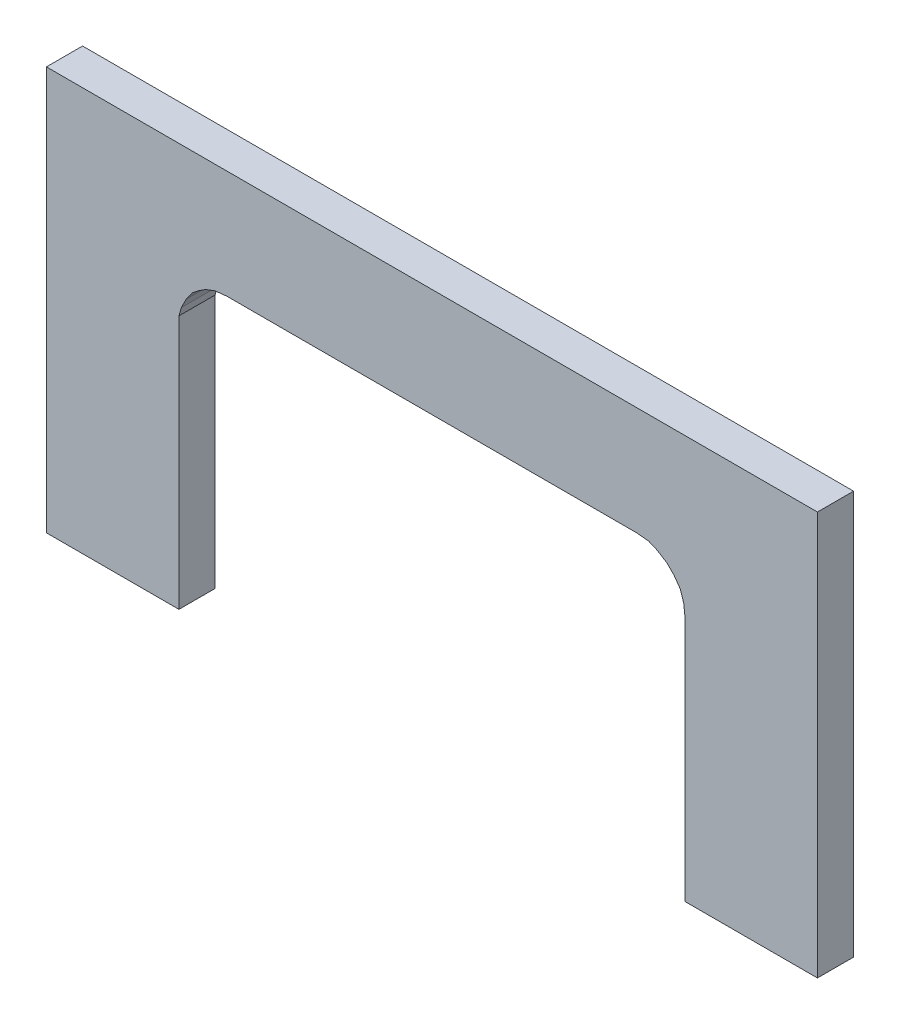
ISO-10303-21;
HEADER;
FILE_DESCRIPTION(('STEP AP214'),'2;1');
FILE_NAME('part.step','',(''),(''),'','','');
FILE_SCHEMA(('AUTOMOTIVE_DESIGN { 1 0 10303 214 1 1 1 1 }'));
ENDSEC;
DATA;
#1=APPLICATION_CONTEXT('core data for automotive mechanical design processes');
#2=APPLICATION_PROTOCOL_DEFINITION('international standard','automotive_design',2000,#1);
#3=PRODUCT_CONTEXT('',#1,'mechanical');
#4=PRODUCT('Part','Part','',(#3));
#5=PRODUCT_RELATED_PRODUCT_CATEGORY('part','',(#4));
#6=PRODUCT_DEFINITION_FORMATION('','',#4);
#7=PRODUCT_DEFINITION_CONTEXT('part definition',#1,'design');
#8=PRODUCT_DEFINITION('design','',#6,#7);
#9=PRODUCT_DEFINITION_SHAPE('','',#8);
#10=(LENGTH_UNIT() NAMED_UNIT(*) SI_UNIT(.MILLI.,.METRE.));
#11=(NAMED_UNIT(*) PLANE_ANGLE_UNIT() SI_UNIT($,.RADIAN.));
#12=(NAMED_UNIT(*) SI_UNIT($,.STERADIAN.) SOLID_ANGLE_UNIT());
#13=UNCERTAINTY_MEASURE_WITH_UNIT(LENGTH_MEASURE(1.E-05),#10,'distance_accuracy_value','');
#14=(GEOMETRIC_REPRESENTATION_CONTEXT(3) GLOBAL_UNCERTAINTY_ASSIGNED_CONTEXT((#13)) GLOBAL_UNIT_ASSIGNED_CONTEXT((#10,
#11,#12)) REPRESENTATION_CONTEXT('',''));
#15=CARTESIAN_POINT('',(0.,0.,0.));
#16=DIRECTION('',(0.,0.,1.));
#17=DIRECTION('',(1.,0.,0.));
#18=AXIS2_PLACEMENT_3D('',#15,#16,#17);
#19=CARTESIAN_POINT('',(-3.19999868,-1.67500046,0.2999994));
#20=DIRECTION('',(0.,0.,1.));
#21=DIRECTION('',(1.,0.,0.));
#22=AXIS2_PLACEMENT_3D('',#19,#20,#21);
#23=PLANE('',#22);
#24=DIRECTION('',(1.,0.,0.));
#25=VECTOR('',#24,1.);
#26=CARTESIAN_POINT('',(-3.19999868,1.67500046,0.2999994));
#27=LINE('',#26,#25);
#28=CARTESIAN_POINT('',(-3.19999868,1.67500046,0.2999994));
#29=VERTEX_POINT('',#28);
#30=CARTESIAN_POINT('',(3.19999868,1.67500046,0.2999994));
#31=VERTEX_POINT('',#30);
#32=EDGE_CURVE('E257',#29,#31,#27,.T.);
#33=ORIENTED_EDGE('',*,*,#32,.F.);
#34=DIRECTION('',(0.,1.,0.));
#35=VECTOR('',#34,1.);
#36=CARTESIAN_POINT('',(-3.19999868,-1.67500046,0.2999994));
#37=LINE('',#36,#35);
#38=CARTESIAN_POINT('',(-3.19999868,-1.67500046,0.2999994));
#39=VERTEX_POINT('',#38);
#40=EDGE_CURVE('E178',#39,#29,#37,.T.);
#41=ORIENTED_EDGE('',*,*,#40,.F.);
#42=DIRECTION('',(1.,0.,0.));
#43=VECTOR('',#42,1.);
#44=CARTESIAN_POINT('',(-2.10000088,-1.67500046,0.2999994));
#45=LINE('',#44,#43);
#46=CARTESIAN_POINT('',(-2.10000088,-1.67500046,0.2999994));
#47=VERTEX_POINT('',#46);
#48=EDGE_CURVE('E20',#47,#39,#45,.F.);
#49=ORIENTED_EDGE('',*,*,#48,.F.);
#50=DIRECTION('',(0.,1.,0.));
#51=VECTOR('',#50,1.);
#52=CARTESIAN_POINT('',(-2.10000088,0.4350004,0.2999994));
#53=LINE('',#52,#51);
#54=CARTESIAN_POINT('',(-2.10000087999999,0.435000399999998,0.2999994));
#55=VERTEX_POINT('',#54);
#56=EDGE_CURVE('E167',#55,#47,#53,.F.);
#57=ORIENTED_EDGE('',*,*,#56,.F.);
#58=DIRECTION('',(0.274721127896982,0.961523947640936,0.));
#59=VECTOR('',#58,1.);
#60=CARTESIAN_POINT('',(-2.08000092,0.50500026,0.2999994));
#61=LINE('',#60,#59);
#62=CARTESIAN_POINT('',(-2.08000092,0.50500026,0.2999994));
#63=VERTEX_POINT('',#62);
#64=EDGE_CURVE('E162',#63,#55,#61,.F.);
#65=ORIENTED_EDGE('',*,*,#64,.F.);
#66=DIRECTION('',(0.447213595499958,0.894427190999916,0.));
#67=VECTOR('',#66,1.);
#68=CARTESIAN_POINT('',(-2.040001,0.5850001,0.2999994));
#69=LINE('',#68,#67);
#70=CARTESIAN_POINT('',(-2.040001,0.585000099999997,0.2999994));
#71=VERTEX_POINT('',#70);
#72=EDGE_CURVE('E189',#71,#63,#69,.F.);
#73=ORIENTED_EDGE('',*,*,#72,.F.);
#74=DIRECTION('',(0.581238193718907,0.81373347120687,0.));
#75=VECTOR('',#74,1.);
#76=CARTESIAN_POINT('',(-1.9900011,0.65499996,0.2999994));
#77=LINE('',#76,#75);
#78=CARTESIAN_POINT('',(-1.9900011,0.654999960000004,0.2999994));
#79=VERTEX_POINT('',#78);
#80=EDGE_CURVE('E193',#79,#71,#77,.F.);
#81=ORIENTED_EDGE('',*,*,#80,.F.);
#82=DIRECTION('',(0.780868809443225,0.62469504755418,0.));
#83=VECTOR('',#82,1.);
#84=CARTESIAN_POINT('',(-1.9400012,0.69499988,0.2999994));
#85=LINE('',#84,#83);
#86=CARTESIAN_POINT('',(-1.9400012,0.694999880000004,0.2999994));
#87=VERTEX_POINT('',#86);
#88=EDGE_CURVE('E197',#87,#79,#85,.F.);
#89=ORIENTED_EDGE('',*,*,#88,.F.);
#90=DIRECTION('',(0.832050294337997,0.554700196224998,0.));
#91=VECTOR('',#90,1.);
#92=CARTESIAN_POINT('',(-1.88000132,0.7349998,0.2999994));
#93=LINE('',#92,#91);
#94=CARTESIAN_POINT('',(-1.88000132,0.734999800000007,0.2999994));
#95=VERTEX_POINT('',#94);
#96=EDGE_CURVE('E201',#95,#87,#93,.F.);
#97=ORIENTED_EDGE('',*,*,#96,.F.);
#98=DIRECTION('',(0.936329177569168,0.351123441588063,0.));
#99=VECTOR('',#98,1.);
#100=CARTESIAN_POINT('',(-1.80000148,0.76499974,0.2999994));
#101=LINE('',#100,#99);
#102=CARTESIAN_POINT('',(-1.80000148,0.764999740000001,0.2999994));
#103=VERTEX_POINT('',#102);
#104=EDGE_CURVE('E205',#103,#95,#101,.F.);
#105=ORIENTED_EDGE('',*,*,#104,.F.);
#106=DIRECTION('',(0.995037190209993,0.0995037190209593,0.));
#107=VECTOR('',#106,1.);
#108=CARTESIAN_POINT('',(-1.70000168,0.77499972,0.2999994));
#109=LINE('',#108,#107);
#110=CARTESIAN_POINT('',(-1.70000168,0.77499972,0.2999994));
#111=VERTEX_POINT('',#110);
#112=EDGE_CURVE('E209',#111,#103,#109,.F.);
#113=ORIENTED_EDGE('',*,*,#112,.F.);
#114=DIRECTION('',(1.,0.,0.));
#115=VECTOR('',#114,1.);
#116=CARTESIAN_POINT('',(1.70000168,0.77499972,0.2999994));
#117=LINE('',#116,#115);
#118=CARTESIAN_POINT('',(1.70000168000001,0.774999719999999,0.2999994));
#119=VERTEX_POINT('',#118);
#120=EDGE_CURVE('E213',#119,#111,#117,.F.);
#121=ORIENTED_EDGE('',*,*,#120,.F.);
#122=DIRECTION('',(0.995036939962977,-0.0995062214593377,0.));
#123=VECTOR('',#122,1.);
#124=CARTESIAN_POINT('',(1.79999894,0.76499974,0.2999994));
#125=LINE('',#124,#123);
#126=CARTESIAN_POINT('',(1.79999894,0.764999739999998,0.2999994));
#127=VERTEX_POINT('',#126);
#128=EDGE_CURVE('E217',#127,#119,#125,.F.);
#129=ORIENTED_EDGE('',*,*,#128,.F.);
#130=DIRECTION('',(0.91914503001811,-0.393919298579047,0.));
#131=VECTOR('',#130,1.);
#132=CARTESIAN_POINT('',(1.8699988,0.7349998,0.2999994));
#133=LINE('',#132,#131);
#134=CARTESIAN_POINT('',(1.8699988,0.734999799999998,0.2999994));
#135=VERTEX_POINT('',#134);
#136=EDGE_CURVE('E221',#135,#127,#133,.F.);
#137=ORIENTED_EDGE('',*,*,#136,.F.);
#138=DIRECTION('',(0.847998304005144,-0.52999894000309,0.));
#139=VECTOR('',#138,1.);
#140=CARTESIAN_POINT('',(1.94999864,0.6849999,0.2999994));
#141=LINE('',#140,#139);
#142=CARTESIAN_POINT('',(1.94999864,0.6849999,0.2999994));
#143=VERTEX_POINT('',#142);
#144=EDGE_CURVE('E225',#143,#135,#141,.F.);
#145=ORIENTED_EDGE('',*,*,#144,.F.);
#146=DIRECTION('',(0.707106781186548,-0.707106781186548,0.));
#147=VECTOR('',#146,1.);
#148=CARTESIAN_POINT('',(2.00999852,0.62500002,0.2999994));
#149=LINE('',#148,#147);
#150=CARTESIAN_POINT('',(2.00999852,0.625000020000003,0.2999994));
#151=VERTEX_POINT('',#150);
#152=EDGE_CURVE('E229',#151,#143,#149,.F.);
#153=ORIENTED_EDGE('',*,*,#152,.F.);
#154=DIRECTION('',(0.581238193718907,-0.81373347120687,0.));
#155=VECTOR('',#154,1.);
#156=CARTESIAN_POINT('',(2.05999842,0.55500016,0.2999994));
#157=LINE('',#156,#155);
#158=CARTESIAN_POINT('',(2.05999842,0.55500016,0.2999994));
#159=VERTEX_POINT('',#158);
#160=EDGE_CURVE('E233',#159,#151,#157,.F.);
#161=ORIENTED_EDGE('',*,*,#160,.F.);
#162=DIRECTION('',(0.316227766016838,-0.948683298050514,0.));
#163=VECTOR('',#162,1.);
#164=CARTESIAN_POINT('',(2.08999836,0.46500034,0.2999994));
#165=LINE('',#164,#163);
#166=CARTESIAN_POINT('',(2.08999835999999,0.465000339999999,0.2999994));
#167=VERTEX_POINT('',#166);
#168=EDGE_CURVE('E237',#167,#159,#165,.F.);
#169=ORIENTED_EDGE('',*,*,#168,.F.);
#170=DIRECTION('',(0.110459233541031,-0.993880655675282,0.));
#171=VECTOR('',#170,1.);
#172=CARTESIAN_POINT('',(2.10000088,0.37500052,0.2999994));
#173=LINE('',#172,#171);
#174=CARTESIAN_POINT('',(2.10000088,0.375000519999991,0.2999994));
#175=VERTEX_POINT('',#174);
#176=EDGE_CURVE('E241',#175,#167,#173,.F.);
#177=ORIENTED_EDGE('',*,*,#176,.F.);
#178=DIRECTION('',(0.,1.,0.));
#179=VECTOR('',#178,1.);
#180=CARTESIAN_POINT('',(2.10000088,-1.67500046,0.2999994));
#181=LINE('',#180,#179);
#182=CARTESIAN_POINT('',(2.10000088,-1.67500046,0.2999994));
#183=VERTEX_POINT('',#182);
#184=EDGE_CURVE('E245',#183,#175,#181,.T.);
#185=ORIENTED_EDGE('',*,*,#184,.F.);
#186=DIRECTION('',(1.,0.,0.));
#187=VECTOR('',#186,1.);
#188=CARTESIAN_POINT('',(3.19999868,-1.67500046,0.2999994));
#189=LINE('',#188,#187);
#190=CARTESIAN_POINT('',(3.19999868,-1.67500046,0.2999994));
#191=VERTEX_POINT('',#190);
#192=EDGE_CURVE('E249',#191,#183,#189,.F.);
#193=ORIENTED_EDGE('',*,*,#192,.F.);
#194=DIRECTION('',(0.,1.,0.));
#195=VECTOR('',#194,1.);
#196=CARTESIAN_POINT('',(3.19999868,1.67500046,0.2999994));
#197=LINE('',#196,#195);
#198=EDGE_CURVE('E253',#31,#191,#197,.F.);
#199=ORIENTED_EDGE('',*,*,#198,.F.);
#200=EDGE_LOOP('',(#33,#41,#49,#57,#65,#73,#81,#89,#97,#105,#113,#121,#129,#137,#145,#153,#161,
#169,#177,#185,#193,#199));
#201=FACE_BOUND('',#200,.T.);
#202=ADVANCED_FACE('F17',(#201),#23,.T.);
#203=CARTESIAN_POINT('',(-2.10000088,-1.67500046,0.));
#204=DIRECTION('',(0.,-1.,0.));
#205=DIRECTION('',(0.,0.,-1.));
#206=AXIS2_PLACEMENT_3D('',#203,#204,#205);
#207=PLANE('',#206);
#208=DIRECTION('',(0.,0.,1.));
#209=VECTOR('',#208,1.);
#210=CARTESIAN_POINT('',(-3.19999868,-1.67500046,0.));
#211=LINE('',#210,#209);
#212=CARTESIAN_POINT('',(-3.19999868,-1.67500046,0.));
#213=VERTEX_POINT('',#212);
#214=EDGE_CURVE('E261',#213,#39,#211,.T.);
#215=ORIENTED_EDGE('',*,*,#214,.F.);
#216=DIRECTION('',(1.,0.,0.));
#217=VECTOR('',#216,1.);
#218=CARTESIAN_POINT('',(-3.19999868,-1.67500046,0.));
#219=LINE('',#218,#217);
#220=CARTESIAN_POINT('',(-2.10000088,-1.67500046,0.));
#221=VERTEX_POINT('',#220);
#222=EDGE_CURVE('E184',#213,#221,#219,.T.);
#223=ORIENTED_EDGE('',*,*,#222,.T.);
#224=DIRECTION('',(0.,0.,-1.));
#225=VECTOR('',#224,1.);
#226=CARTESIAN_POINT('',(-2.10000088,-1.67500046,0.));
#227=LINE('',#226,#225);
#228=EDGE_CURVE('E172',#47,#221,#227,.T.);
#229=ORIENTED_EDGE('',*,*,#228,.F.);
#230=ORIENTED_EDGE('',*,*,#48,.T.);
#231=EDGE_LOOP('',(#215,#223,#229,#230));
#232=FACE_BOUND('',#231,.T.);
#233=ADVANCED_FACE('F183',(#232),#207,.T.);
#234=CARTESIAN_POINT('',(-2.10000088,0.4350004,0.));
#235=DIRECTION('',(1.,0.,0.));
#236=DIRECTION('',(0.,0.,-1.));
#237=AXIS2_PLACEMENT_3D('',#234,#235,#236);
#238=PLANE('',#237);
#239=ORIENTED_EDGE('',*,*,#228,.T.);
#240=DIRECTION('',(0.,1.,0.));
#241=VECTOR('',#240,1.);
#242=CARTESIAN_POINT('',(-2.10000088,-1.67500046,0.));
#243=LINE('',#242,#241);
#244=CARTESIAN_POINT('',(-2.10000087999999,0.435000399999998,0.));
#245=VERTEX_POINT('',#244);
#246=EDGE_CURVE('E266',#221,#245,#243,.T.);
#247=ORIENTED_EDGE('',*,*,#246,.T.);
#248=DIRECTION('',(0.,0.,1.));
#249=VECTOR('',#248,1.);
#250=CARTESIAN_POINT('',(-2.10000087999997,0.435000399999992,0.));
#251=LINE('',#250,#249);
#252=EDGE_CURVE('E174',#55,#245,#251,.F.);
#253=ORIENTED_EDGE('',*,*,#252,.F.);
#254=ORIENTED_EDGE('',*,*,#56,.T.);
#255=EDGE_LOOP('',(#239,#247,#253,#254));
#256=FACE_BOUND('',#255,.T.);
#257=ADVANCED_FACE('F169',(#256),#238,.T.);
#258=CARTESIAN_POINT('',(-2.08000092,0.50500026,0.));
#259=DIRECTION('',(0.961523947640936,-0.274721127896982,0.));
#260=DIRECTION('',(0.274721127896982,0.961523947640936,0.));
#261=AXIS2_PLACEMENT_3D('',#258,#259,#260);
#262=PLANE('',#261);
#263=ORIENTED_EDGE('',*,*,#252,.T.);
#264=DIRECTION('',(0.274721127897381,0.961523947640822,0.));
#265=VECTOR('',#264,1.);
#266=CARTESIAN_POINT('',(-2.10000088,0.4350004,0.));
#267=LINE('',#266,#265);
#268=CARTESIAN_POINT('',(-2.08000092,0.50500026,0.));
#269=VERTEX_POINT('',#268);
#270=EDGE_CURVE('E268',#245,#269,#267,.T.);
#271=ORIENTED_EDGE('',*,*,#270,.T.);
#272=DIRECTION('',(0.,0.,1.));
#273=VECTOR('',#272,1.);
#274=CARTESIAN_POINT('',(-2.08000092,0.50500026,0.));
#275=LINE('',#274,#273);
#276=EDGE_CURVE('E191',#63,#269,#275,.F.);
#277=ORIENTED_EDGE('',*,*,#276,.F.);
#278=ORIENTED_EDGE('',*,*,#64,.T.);
#279=EDGE_LOOP('',(#263,#271,#277,#278));
#280=FACE_BOUND('',#279,.T.);
#281=ADVANCED_FACE('F414',(#280),#262,.T.);
#282=CARTESIAN_POINT('',(-2.040001,0.5850001,0.));
#283=DIRECTION('',(0.894427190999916,-0.447213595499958,0.));
#284=DIRECTION('',(0.447213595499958,0.894427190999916,0.));
#285=AXIS2_PLACEMENT_3D('',#282,#283,#284);
#286=PLANE('',#285);
#287=ORIENTED_EDGE('',*,*,#276,.T.);
#288=DIRECTION('',(0.447213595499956,0.894427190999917,0.));
#289=VECTOR('',#288,1.);
#290=CARTESIAN_POINT('',(-2.08000092,0.50500026,0.));
#291=LINE('',#290,#289);
#292=CARTESIAN_POINT('',(-2.040001,0.585000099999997,0.));
#293=VERTEX_POINT('',#292);
#294=EDGE_CURVE('E271',#269,#293,#291,.T.);
#295=ORIENTED_EDGE('',*,*,#294,.T.);
#296=DIRECTION('',(0.,0.,1.));
#297=VECTOR('',#296,1.);
#298=CARTESIAN_POINT('',(-2.04000099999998,0.585000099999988,0.));
#299=LINE('',#298,#297);
#300=EDGE_CURVE('E195',#71,#293,#299,.F.);
#301=ORIENTED_EDGE('',*,*,#300,.F.);
#302=ORIENTED_EDGE('',*,*,#72,.T.);
#303=EDGE_LOOP('',(#287,#295,#301,#302));
#304=FACE_BOUND('',#303,.T.);
#305=ADVANCED_FACE('F413',(#304),#286,.T.);
#306=CARTESIAN_POINT('',(-1.9900011,0.65499996,0.));
#307=DIRECTION('',(0.81373347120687,-0.581238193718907,0.));
#308=DIRECTION('',(0.581238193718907,0.81373347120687,0.));
#309=AXIS2_PLACEMENT_3D('',#306,#307,#308);
#310=PLANE('',#309);
#311=ORIENTED_EDGE('',*,*,#300,.T.);
#312=DIRECTION('',(0.581238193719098,0.813733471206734,0.));
#313=VECTOR('',#312,1.);
#314=CARTESIAN_POINT('',(-2.040001,0.5850001,0.));
#315=LINE('',#314,#313);
#316=CARTESIAN_POINT('',(-1.9900011,0.654999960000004,0.));
#317=VERTEX_POINT('',#316);
#318=EDGE_CURVE('E274',#293,#317,#315,.T.);
#319=ORIENTED_EDGE('',*,*,#318,.T.);
#320=DIRECTION('',(0.,0.,1.));
#321=VECTOR('',#320,1.);
#322=CARTESIAN_POINT('',(-1.99000110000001,0.654999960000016,0.));
#323=LINE('',#322,#321);
#324=EDGE_CURVE('E199',#79,#317,#323,.F.);
#325=ORIENTED_EDGE('',*,*,#324,.F.);
#326=ORIENTED_EDGE('',*,*,#80,.T.);
#327=EDGE_LOOP('',(#311,#319,#325,#326));
#328=FACE_BOUND('',#327,.T.);
#329=ADVANCED_FACE('F407',(#328),#310,.T.);
#330=CARTESIAN_POINT('',(-1.9400012,0.69499988,0.));
#331=DIRECTION('',(0.62469504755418,-0.780868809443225,0.));
#332=DIRECTION('',(0.780868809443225,0.62469504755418,0.));
#333=AXIS2_PLACEMENT_3D('',#330,#331,#332);
#334=PLANE('',#333);
#335=ORIENTED_EDGE('',*,*,#324,.T.);
#336=DIRECTION('',(0.78086880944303,0.624695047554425,0.));
#337=VECTOR('',#336,1.);
#338=CARTESIAN_POINT('',(-1.9900011,0.65499996,0.));
#339=LINE('',#338,#337);
#340=CARTESIAN_POINT('',(-1.9400012,0.694999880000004,0.));
#341=VERTEX_POINT('',#340);
#342=EDGE_CURVE('E277',#317,#341,#339,.T.);
#343=ORIENTED_EDGE('',*,*,#342,.T.);
#344=DIRECTION('',(0.,0.,1.));
#345=VECTOR('',#344,1.);
#346=CARTESIAN_POINT('',(-1.94000120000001,0.694999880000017,0.));
#347=LINE('',#346,#345);
#348=EDGE_CURVE('E203',#87,#341,#347,.F.);
#349=ORIENTED_EDGE('',*,*,#348,.F.);
#350=ORIENTED_EDGE('',*,*,#88,.T.);
#351=EDGE_LOOP('',(#335,#343,#349,#350));
#352=FACE_BOUND('',#351,.T.);
#353=ADVANCED_FACE('F403',(#352),#334,.T.);
#354=CARTESIAN_POINT('',(-1.88000132,0.7349998,0.));
#355=DIRECTION('',(0.554700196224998,-0.832050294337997,0.));
#356=DIRECTION('',(0.832050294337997,0.554700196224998,0.));
#357=AXIS2_PLACEMENT_3D('',#354,#355,#356);
#358=PLANE('',#357);
#359=ORIENTED_EDGE('',*,*,#348,.T.);
#360=DIRECTION('',(0.832050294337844,0.554700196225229,0.));
#361=VECTOR('',#360,1.);
#362=CARTESIAN_POINT('',(-1.9400012,0.69499988,0.));
#363=LINE('',#362,#361);
#364=CARTESIAN_POINT('',(-1.88000132,0.734999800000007,0.));
#365=VERTEX_POINT('',#364);
#366=EDGE_CURVE('E280',#341,#365,#363,.T.);
#367=ORIENTED_EDGE('',*,*,#366,.T.);
#368=DIRECTION('',(0.,0.,1.));
#369=VECTOR('',#368,1.);
#370=CARTESIAN_POINT('',(-1.88000132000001,0.734999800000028,0.));
#371=LINE('',#370,#369);
#372=EDGE_CURVE('E207',#95,#365,#371,.F.);
#373=ORIENTED_EDGE('',*,*,#372,.F.);
#374=ORIENTED_EDGE('',*,*,#96,.T.);
#375=EDGE_LOOP('',(#359,#367,#373,#374));
#376=FACE_BOUND('',#375,.T.);
#377=ADVANCED_FACE('F397',(#376),#358,.T.);
#378=CARTESIAN_POINT('',(-1.80000148,0.76499974,0.));
#379=DIRECTION('',(0.351123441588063,-0.936329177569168,0.));
#380=DIRECTION('',(0.936329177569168,0.351123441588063,0.));
#381=AXIS2_PLACEMENT_3D('',#378,#379,#380);
#382=PLANE('',#381);
#383=ORIENTED_EDGE('',*,*,#372,.T.);
#384=DIRECTION('',(0.936329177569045,0.35112344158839,0.));
#385=VECTOR('',#384,1.);
#386=CARTESIAN_POINT('',(-1.88000132,0.7349998,0.));
#387=LINE('',#386,#385);
#388=CARTESIAN_POINT('',(-1.80000148,0.764999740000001,0.));
#389=VERTEX_POINT('',#388);
#390=EDGE_CURVE('E283',#365,#389,#387,.T.);
#391=ORIENTED_EDGE('',*,*,#390,.T.);
#392=DIRECTION('',(0.,0.,1.));
#393=VECTOR('',#392,1.);
#394=CARTESIAN_POINT('',(-1.80000148,0.764999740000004,0.));
#395=LINE('',#394,#393);
#396=EDGE_CURVE('E211',#103,#389,#395,.F.);
#397=ORIENTED_EDGE('',*,*,#396,.F.);
#398=ORIENTED_EDGE('',*,*,#104,.T.);
#399=EDGE_LOOP('',(#383,#391,#397,#398));
#400=FACE_BOUND('',#399,.T.);
#401=ADVANCED_FACE('F393',(#400),#382,.T.);
#402=CARTESIAN_POINT('',(-1.70000168,0.77499972,0.));
#403=DIRECTION('',(0.0995037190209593,-0.995037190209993,0.));
#404=DIRECTION('',(0.995037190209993,0.0995037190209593,0.));
#405=AXIS2_PLACEMENT_3D('',#402,#403,#404);
#406=PLANE('',#405);
#407=ORIENTED_EDGE('',*,*,#396,.T.);
#408=DIRECTION('',(0.995037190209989,0.099503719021,0.));
#409=VECTOR('',#408,1.);
#410=CARTESIAN_POINT('',(-1.80000148,0.76499974,0.));
#411=LINE('',#410,#409);
#412=CARTESIAN_POINT('',(-1.70000168,0.77499972,0.));
#413=VERTEX_POINT('',#412);
#414=EDGE_CURVE('E286',#389,#413,#411,.T.);
#415=ORIENTED_EDGE('',*,*,#414,.T.);
#416=DIRECTION('',(0.,0.,-1.));
#417=VECTOR('',#416,1.);
#418=CARTESIAN_POINT('',(-1.70000168,0.77499972,0.));
#419=LINE('',#418,#417);
#420=EDGE_CURVE('E215',#111,#413,#419,.T.);
#421=ORIENTED_EDGE('',*,*,#420,.F.);
#422=ORIENTED_EDGE('',*,*,#112,.T.);
#423=EDGE_LOOP('',(#407,#415,#421,#422));
#424=FACE_BOUND('',#423,.T.);
#425=ADVANCED_FACE('F387',(#424),#406,.T.);
#426=CARTESIAN_POINT('',(1.70000168,0.77499972,0.));
#427=DIRECTION('',(0.,-1.,0.));
#428=DIRECTION('',(0.,0.,-1.));
#429=AXIS2_PLACEMENT_3D('',#426,#427,#428);
#430=PLANE('',#429);
#431=ORIENTED_EDGE('',*,*,#420,.T.);
#432=DIRECTION('',(1.,0.,0.));
#433=VECTOR('',#432,1.);
#434=CARTESIAN_POINT('',(-3.19999868,0.77499972,0.));
#435=LINE('',#434,#433);
#436=CARTESIAN_POINT('',(1.70000168,0.774999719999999,0.));
#437=VERTEX_POINT('',#436);
#438=EDGE_CURVE('E289',#413,#437,#435,.T.);
#439=ORIENTED_EDGE('',*,*,#438,.T.);
#440=DIRECTION('',(0.,0.,1.));
#441=VECTOR('',#440,1.);
#442=CARTESIAN_POINT('',(1.70000168,0.774999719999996,0.));
#443=LINE('',#442,#441);
#444=EDGE_CURVE('E219',#119,#437,#443,.F.);
#445=ORIENTED_EDGE('',*,*,#444,.F.);
#446=ORIENTED_EDGE('',*,*,#120,.T.);
#447=EDGE_LOOP('',(#431,#439,#445,#446));
#448=FACE_BOUND('',#447,.T.);
#449=ADVANCED_FACE('F383',(#448),#430,.T.);
#450=CARTESIAN_POINT('',(1.79999894,0.76499974,0.));
#451=DIRECTION('',(-0.0995062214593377,-0.995036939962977,0.));
#452=DIRECTION('',(0.995036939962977,-0.0995062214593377,0.));
#453=AXIS2_PLACEMENT_3D('',#450,#451,#452);
#454=PLANE('',#453);
#455=ORIENTED_EDGE('',*,*,#444,.T.);
#456=DIRECTION('',(0.995036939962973,-0.0995062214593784,0.));
#457=VECTOR('',#456,1.);
#458=CARTESIAN_POINT('',(1.70000168,0.77499972,0.));
#459=LINE('',#458,#457);
#460=CARTESIAN_POINT('',(1.79999894,0.764999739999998,0.));
#461=VERTEX_POINT('',#460);
#462=EDGE_CURVE('E292',#437,#461,#459,.T.);
#463=ORIENTED_EDGE('',*,*,#462,.T.);
#464=DIRECTION('',(0.,0.,1.));
#465=VECTOR('',#464,1.);
#466=CARTESIAN_POINT('',(1.79999894,0.764999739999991,0.));
#467=LINE('',#466,#465);
#468=EDGE_CURVE('E223',#127,#461,#467,.F.);
#469=ORIENTED_EDGE('',*,*,#468,.F.);
#470=ORIENTED_EDGE('',*,*,#128,.T.);
#471=EDGE_LOOP('',(#455,#463,#469,#470));
#472=FACE_BOUND('',#471,.T.);
#473=ADVANCED_FACE('F377',(#472),#454,.T.);
#474=CARTESIAN_POINT('',(1.8699988,0.7349998,0.));
#475=DIRECTION('',(-0.393919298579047,-0.91914503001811,0.));
#476=DIRECTION('',(0.91914503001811,-0.393919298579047,0.));
#477=AXIS2_PLACEMENT_3D('',#474,#475,#476);
#478=PLANE('',#477);
#479=ORIENTED_EDGE('',*,*,#468,.T.);
#480=DIRECTION('',(0.919145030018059,-0.393919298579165,0.));
#481=VECTOR('',#480,1.);
#482=CARTESIAN_POINT('',(1.79999894,0.76499974,0.));
#483=LINE('',#482,#481);
#484=CARTESIAN_POINT('',(1.8699988,0.734999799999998,0.));
#485=VERTEX_POINT('',#484);
#486=EDGE_CURVE('E295',#461,#485,#483,.T.);
#487=ORIENTED_EDGE('',*,*,#486,.T.);
#488=DIRECTION('',(0.,0.,1.));
#489=VECTOR('',#488,1.);
#490=CARTESIAN_POINT('',(1.86999879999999,0.734999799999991,0.));
#491=LINE('',#490,#489);
#492=EDGE_CURVE('E227',#135,#485,#491,.F.);
#493=ORIENTED_EDGE('',*,*,#492,.F.);
#494=ORIENTED_EDGE('',*,*,#136,.T.);
#495=EDGE_LOOP('',(#479,#487,#493,#494));
#496=FACE_BOUND('',#495,.T.);
#497=ADVANCED_FACE('F373',(#496),#478,.T.);
#498=CARTESIAN_POINT('',(1.94999864,0.6849999,0.));
#499=DIRECTION('',(-0.52999894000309,-0.847998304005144,0.));
#500=DIRECTION('',(0.847998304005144,-0.52999894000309,0.));
#501=AXIS2_PLACEMENT_3D('',#498,#499,#500);
#502=PLANE('',#501);
#503=ORIENTED_EDGE('',*,*,#492,.T.);
#504=DIRECTION('',(0.847998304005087,-0.529998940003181,0.));
#505=VECTOR('',#504,1.);
#506=CARTESIAN_POINT('',(1.8699988,0.7349998,0.));
#507=LINE('',#506,#505);
#508=CARTESIAN_POINT('',(1.94999864,0.6849999,0.));
#509=VERTEX_POINT('',#508);
#510=EDGE_CURVE('E298',#485,#509,#507,.T.);
#511=ORIENTED_EDGE('',*,*,#510,.T.);
#512=DIRECTION('',(0.,0.,1.));
#513=VECTOR('',#512,1.);
#514=CARTESIAN_POINT('',(1.94999864,0.6849999,0.));
#515=LINE('',#514,#513);
#516=EDGE_CURVE('E231',#143,#509,#515,.F.);
#517=ORIENTED_EDGE('',*,*,#516,.F.);
#518=ORIENTED_EDGE('',*,*,#144,.T.);
#519=EDGE_LOOP('',(#503,#511,#517,#518));
#520=FACE_BOUND('',#519,.T.);
#521=ADVANCED_FACE('F367',(#520),#502,.T.);
#522=CARTESIAN_POINT('',(2.00999852,0.62500002,0.));
#523=DIRECTION('',(-0.707106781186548,-0.707106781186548,0.));
#524=DIRECTION('',(0.707106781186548,-0.707106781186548,0.));
#525=AXIS2_PLACEMENT_3D('',#522,#523,#524);
#526=PLANE('',#525);
#527=ORIENTED_EDGE('',*,*,#516,.T.);
#528=DIRECTION('',(0.707106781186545,-0.70710678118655,0.));
#529=VECTOR('',#528,1.);
#530=CARTESIAN_POINT('',(1.94999864,0.6849999,0.));
#531=LINE('',#530,#529);
#532=CARTESIAN_POINT('',(2.00999852,0.625000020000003,0.));
#533=VERTEX_POINT('',#532);
#534=EDGE_CURVE('E301',#509,#533,#531,.T.);
#535=ORIENTED_EDGE('',*,*,#534,.T.);
#536=DIRECTION('',(0.,0.,1.));
#537=VECTOR('',#536,1.);
#538=CARTESIAN_POINT('',(2.00999852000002,0.625000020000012,0.));
#539=LINE('',#538,#537);
#540=EDGE_CURVE('E235',#151,#533,#539,.F.);
#541=ORIENTED_EDGE('',*,*,#540,.F.);
#542=ORIENTED_EDGE('',*,*,#152,.T.);
#543=EDGE_LOOP('',(#527,#535,#541,#542));
#544=FACE_BOUND('',#543,.T.);
#545=ADVANCED_FACE('F363',(#544),#526,.T.);
#546=CARTESIAN_POINT('',(2.05999842,0.55500016,0.));
#547=DIRECTION('',(-0.81373347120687,-0.581238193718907,0.));
#548=DIRECTION('',(0.581238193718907,-0.81373347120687,0.));
#549=AXIS2_PLACEMENT_3D('',#546,#547,#548);
#550=PLANE('',#549);
#551=ORIENTED_EDGE('',*,*,#540,.T.);
#552=DIRECTION('',(0.581238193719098,-0.813733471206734,0.));
#553=VECTOR('',#552,1.);
#554=CARTESIAN_POINT('',(2.00999852,0.62500002,0.));
#555=LINE('',#554,#553);
#556=CARTESIAN_POINT('',(2.05999842,0.55500016,0.));
#557=VERTEX_POINT('',#556);
#558=EDGE_CURVE('E304',#533,#557,#555,.T.);
#559=ORIENTED_EDGE('',*,*,#558,.T.);
#560=DIRECTION('',(0.,0.,1.));
#561=VECTOR('',#560,1.);
#562=CARTESIAN_POINT('',(2.05999842,0.55500016,0.));
#563=LINE('',#562,#561);
#564=EDGE_CURVE('E239',#159,#557,#563,.F.);
#565=ORIENTED_EDGE('',*,*,#564,.F.);
#566=ORIENTED_EDGE('',*,*,#160,.T.);
#567=EDGE_LOOP('',(#551,#559,#565,#566));
#568=FACE_BOUND('',#567,.T.);
#569=ADVANCED_FACE('F357',(#568),#550,.T.);
#570=CARTESIAN_POINT('',(2.08999836,0.46500034,0.));
#571=DIRECTION('',(-0.948683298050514,-0.316227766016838,0.));
#572=DIRECTION('',(0.316227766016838,-0.948683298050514,0.));
#573=AXIS2_PLACEMENT_3D('',#570,#571,#572);
#574=PLANE('',#573);
#575=ORIENTED_EDGE('',*,*,#564,.T.);
#576=DIRECTION('',(0.316227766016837,-0.948683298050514,0.));
#577=VECTOR('',#576,1.);
#578=CARTESIAN_POINT('',(2.05999842,0.55500016,0.));
#579=LINE('',#578,#577);
#580=CARTESIAN_POINT('',(2.08999835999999,0.465000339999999,0.));
#581=VERTEX_POINT('',#580);
#582=EDGE_CURVE('E307',#557,#581,#579,.T.);
#583=ORIENTED_EDGE('',*,*,#582,.T.);
#584=DIRECTION('',(0.,0.,1.));
#585=VECTOR('',#584,1.);
#586=CARTESIAN_POINT('',(2.08999835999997,0.465000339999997,0.));
#587=LINE('',#586,#585);
#588=EDGE_CURVE('E243',#167,#581,#587,.F.);
#589=ORIENTED_EDGE('',*,*,#588,.F.);
#590=ORIENTED_EDGE('',*,*,#168,.T.);
#591=EDGE_LOOP('',(#575,#583,#589,#590));
#592=FACE_BOUND('',#591,.T.);
#593=ADVANCED_FACE('F353',(#592),#574,.T.);
#594=CARTESIAN_POINT('',(2.10000088,0.37500052,0.));
#595=DIRECTION('',(-0.993880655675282,-0.110459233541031,0.));
#596=DIRECTION('',(0.110459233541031,-0.993880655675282,0.));
#597=AXIS2_PLACEMENT_3D('',#594,#595,#596);
#598=PLANE('',#597);
#599=ORIENTED_EDGE('',*,*,#588,.T.);
#600=DIRECTION('',(0.110459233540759,-0.993880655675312,0.));
#601=VECTOR('',#600,1.);
#602=CARTESIAN_POINT('',(2.08999836,0.46500034,0.));
#603=LINE('',#602,#601);
#604=CARTESIAN_POINT('',(2.10000088,0.375000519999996,0.));
#605=VERTEX_POINT('',#604);
#606=EDGE_CURVE('E310',#581,#605,#603,.T.);
#607=ORIENTED_EDGE('',*,*,#606,.T.);
#608=DIRECTION('',(0.,0.,1.));
#609=VECTOR('',#608,1.);
#610=CARTESIAN_POINT('',(2.10000088,0.37500052,0.));
#611=LINE('',#610,#609);
#612=EDGE_CURVE('E247',#175,#605,#611,.F.);
#613=ORIENTED_EDGE('',*,*,#612,.F.);
#614=ORIENTED_EDGE('',*,*,#176,.T.);
#615=EDGE_LOOP('',(#599,#607,#613,#614));
#616=FACE_BOUND('',#615,.T.);
#617=ADVANCED_FACE('F347',(#616),#598,.T.);
#618=CARTESIAN_POINT('',(2.10000088,-1.67500046,0.));
#619=DIRECTION('',(-1.,0.,0.));
#620=DIRECTION('',(0.,0.,1.));
#621=AXIS2_PLACEMENT_3D('',#618,#619,#620);
#622=PLANE('',#621);
#623=ORIENTED_EDGE('',*,*,#612,.T.);
#624=DIRECTION('',(0.,1.,0.));
#625=VECTOR('',#624,1.);
#626=CARTESIAN_POINT('',(2.10000088,-1.67500046,0.));
#627=LINE('',#626,#625);
#628=CARTESIAN_POINT('',(2.10000088,-1.67500046,0.));
#629=VERTEX_POINT('',#628);
#630=EDGE_CURVE('E313',#605,#629,#627,.F.);
#631=ORIENTED_EDGE('',*,*,#630,.T.);
#632=DIRECTION('',(0.,0.,-1.));
#633=VECTOR('',#632,1.);
#634=CARTESIAN_POINT('',(2.10000088,-1.67500046,0.));
#635=LINE('',#634,#633);
#636=EDGE_CURVE('E251',#183,#629,#635,.T.);
#637=ORIENTED_EDGE('',*,*,#636,.F.);
#638=ORIENTED_EDGE('',*,*,#184,.T.);
#639=EDGE_LOOP('',(#623,#631,#637,#638));
#640=FACE_BOUND('',#639,.T.);
#641=ADVANCED_FACE('F343',(#640),#622,.T.);
#642=CARTESIAN_POINT('',(3.19999868,-1.67500046,0.));
#643=DIRECTION('',(0.,-1.,0.));
#644=DIRECTION('',(0.,0.,-1.));
#645=AXIS2_PLACEMENT_3D('',#642,#643,#644);
#646=PLANE('',#645);
#647=ORIENTED_EDGE('',*,*,#636,.T.);
#648=DIRECTION('',(1.,0.,0.));
#649=VECTOR('',#648,1.);
#650=CARTESIAN_POINT('',(-3.19999868,-1.67500046,0.));
#651=LINE('',#650,#649);
#652=CARTESIAN_POINT('',(3.19999868,-1.67500046,0.));
#653=VERTEX_POINT('',#652);
#654=EDGE_CURVE('E316',#629,#653,#651,.T.);
#655=ORIENTED_EDGE('',*,*,#654,.T.);
#656=DIRECTION('',(0.,0.,-1.));
#657=VECTOR('',#656,1.);
#658=CARTESIAN_POINT('',(3.19999868,-1.67500046,0.));
#659=LINE('',#658,#657);
#660=EDGE_CURVE('E255',#191,#653,#659,.T.);
#661=ORIENTED_EDGE('',*,*,#660,.F.);
#662=ORIENTED_EDGE('',*,*,#192,.T.);
#663=EDGE_LOOP('',(#647,#655,#661,#662));
#664=FACE_BOUND('',#663,.T.);
#665=ADVANCED_FACE('F337',(#664),#646,.T.);
#666=CARTESIAN_POINT('',(3.19999868,1.67500046,0.));
#667=DIRECTION('',(1.,0.,0.));
#668=DIRECTION('',(0.,0.,-1.));
#669=AXIS2_PLACEMENT_3D('',#666,#667,#668);
#670=PLANE('',#669);
#671=ORIENTED_EDGE('',*,*,#660,.T.);
#672=DIRECTION('',(0.,1.,0.));
#673=VECTOR('',#672,1.);
#674=CARTESIAN_POINT('',(3.19999868,-1.67500046,0.));
#675=LINE('',#674,#673);
#676=CARTESIAN_POINT('',(3.19999868,1.67500046,0.));
#677=VERTEX_POINT('',#676);
#678=EDGE_CURVE('E319',#653,#677,#675,.T.);
#679=ORIENTED_EDGE('',*,*,#678,.T.);
#680=DIRECTION('',(0.,0.,1.));
#681=VECTOR('',#680,1.);
#682=CARTESIAN_POINT('',(3.19999868,1.67500046,0.));
#683=LINE('',#682,#681);
#684=EDGE_CURVE('E259',#31,#677,#683,.F.);
#685=ORIENTED_EDGE('',*,*,#684,.F.);
#686=ORIENTED_EDGE('',*,*,#198,.T.);
#687=EDGE_LOOP('',(#671,#679,#685,#686));
#688=FACE_BOUND('',#687,.T.);
#689=ADVANCED_FACE('F332',(#688),#670,.T.);
#690=CARTESIAN_POINT('',(-3.19999868,1.67500046,0.));
#691=DIRECTION('',(0.,1.,0.));
#692=DIRECTION('',(0.,0.,1.));
#693=AXIS2_PLACEMENT_3D('',#690,#691,#692);
#694=PLANE('',#693);
#695=ORIENTED_EDGE('',*,*,#684,.T.);
#696=DIRECTION('',(1.,0.,0.));
#697=VECTOR('',#696,1.);
#698=CARTESIAN_POINT('',(-3.19999868,1.67500046,0.));
#699=LINE('',#698,#697);
#700=CARTESIAN_POINT('',(-3.19999868,1.67500046,0.));
#701=VERTEX_POINT('',#700);
#702=EDGE_CURVE('E26',#677,#701,#699,.F.);
#703=ORIENTED_EDGE('',*,*,#702,.T.);
#704=DIRECTION('',(0.,0.,1.));
#705=VECTOR('',#704,1.);
#706=CARTESIAN_POINT('',(-3.19999868,1.67500046,0.));
#707=LINE('',#706,#705);
#708=EDGE_CURVE('E34',#29,#701,#707,.F.);
#709=ORIENTED_EDGE('',*,*,#708,.F.);
#710=ORIENTED_EDGE('',*,*,#32,.T.);
#711=EDGE_LOOP('',(#695,#703,#709,#710));
#712=FACE_BOUND('',#711,.T.);
#713=ADVANCED_FACE('F325',(#712),#694,.T.);
#714=CARTESIAN_POINT('',(-3.19999868,-1.67500046,0.));
#715=DIRECTION('',(-1.,0.,0.));
#716=DIRECTION('',(0.,0.,1.));
#717=AXIS2_PLACEMENT_3D('',#714,#715,#716);
#718=PLANE('',#717);
#719=ORIENTED_EDGE('',*,*,#708,.T.);
#720=DIRECTION('',(0.,1.,0.));
#721=VECTOR('',#720,1.);
#722=CARTESIAN_POINT('',(-3.19999868,-1.67500046,0.));
#723=LINE('',#722,#721);
#724=EDGE_CURVE('E11',#701,#213,#723,.F.);
#725=ORIENTED_EDGE('',*,*,#724,.T.);
#726=ORIENTED_EDGE('',*,*,#214,.T.);
#727=ORIENTED_EDGE('',*,*,#40,.T.);
#728=EDGE_LOOP('',(#719,#725,#726,#727));
#729=FACE_BOUND('',#728,.T.);
#730=ADVANCED_FACE('F415',(#729),#718,.T.);
#731=CARTESIAN_POINT('',(-3.19999868,-1.67500046,0.));
#732=DIRECTION('',(0.,0.,1.));
#733=DIRECTION('',(1.,0.,0.));
#734=AXIS2_PLACEMENT_3D('',#731,#732,#733);
#735=PLANE('',#734);
#736=ORIENTED_EDGE('',*,*,#702,.F.);
#737=ORIENTED_EDGE('',*,*,#678,.F.);
#738=ORIENTED_EDGE('',*,*,#654,.F.);
#739=ORIENTED_EDGE('',*,*,#630,.F.);
#740=ORIENTED_EDGE('',*,*,#606,.F.);
#741=ORIENTED_EDGE('',*,*,#582,.F.);
#742=ORIENTED_EDGE('',*,*,#558,.F.);
#743=ORIENTED_EDGE('',*,*,#534,.F.);
#744=ORIENTED_EDGE('',*,*,#510,.F.);
#745=ORIENTED_EDGE('',*,*,#486,.F.);
#746=ORIENTED_EDGE('',*,*,#462,.F.);
#747=ORIENTED_EDGE('',*,*,#438,.F.);
#748=ORIENTED_EDGE('',*,*,#414,.F.);
#749=ORIENTED_EDGE('',*,*,#390,.F.);
#750=ORIENTED_EDGE('',*,*,#366,.F.);
#751=ORIENTED_EDGE('',*,*,#342,.F.);
#752=ORIENTED_EDGE('',*,*,#318,.F.);
#753=ORIENTED_EDGE('',*,*,#294,.F.);
#754=ORIENTED_EDGE('',*,*,#270,.F.);
#755=ORIENTED_EDGE('',*,*,#246,.F.);
#756=ORIENTED_EDGE('',*,*,#222,.F.);
#757=ORIENTED_EDGE('',*,*,#724,.F.);
#758=EDGE_LOOP('',(#736,#737,#738,#739,#740,#741,#742,#743,#744,#745,#746,#747,#748,#749,#750,
#751,#752,#753,#754,#755,#756,#757));
#759=FACE_BOUND('',#758,.T.);
#760=ADVANCED_FACE('F329',(#759),#735,.F.);
#761=CLOSED_SHELL('',(#202,#233,#257,#281,#305,#329,#353,#377,#401,#425,#449,#473,#497,#521,
#545,#569,#593,#617,#641,#665,#689,#713,#730,#760));
#762=MANIFOLD_SOLID_BREP('B1',#761);
#763=ADVANCED_BREP_SHAPE_REPRESENTATION('',(#18,#762),#14);
#764=SHAPE_DEFINITION_REPRESENTATION(#9,#763);
ENDSEC;
END-ISO-10303-21;
